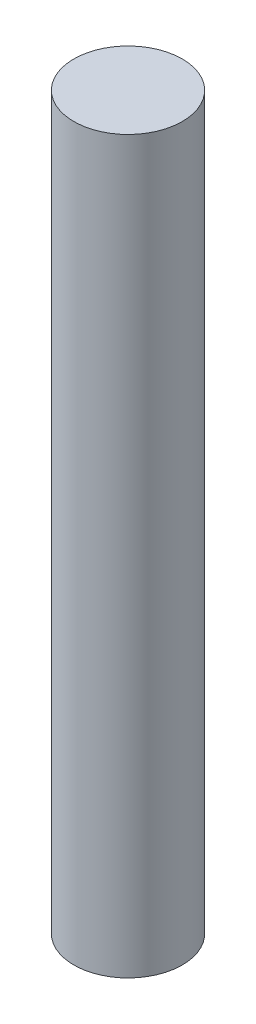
from build123d import *

# Parameters (mm, degrees)
SKETCH1_R           = 1.97
BOSS_EXTRUDE1_DEPTH = 26.54


with BuildPart() as part:
    # Sketch1 → Boss-Extrude1 (new body)
    with BuildSketch(Plane(origin=(0, 0, 0), x_dir=(1, 0, 0), z_dir=(0, 1, 0))):
        with Locations(Location((0, 0, 0), (0, 0, 90))):
            Circle(SKETCH1_R)
    extrude(amount=BOSS_EXTRUDE1_DEPTH)


solid = part.part
